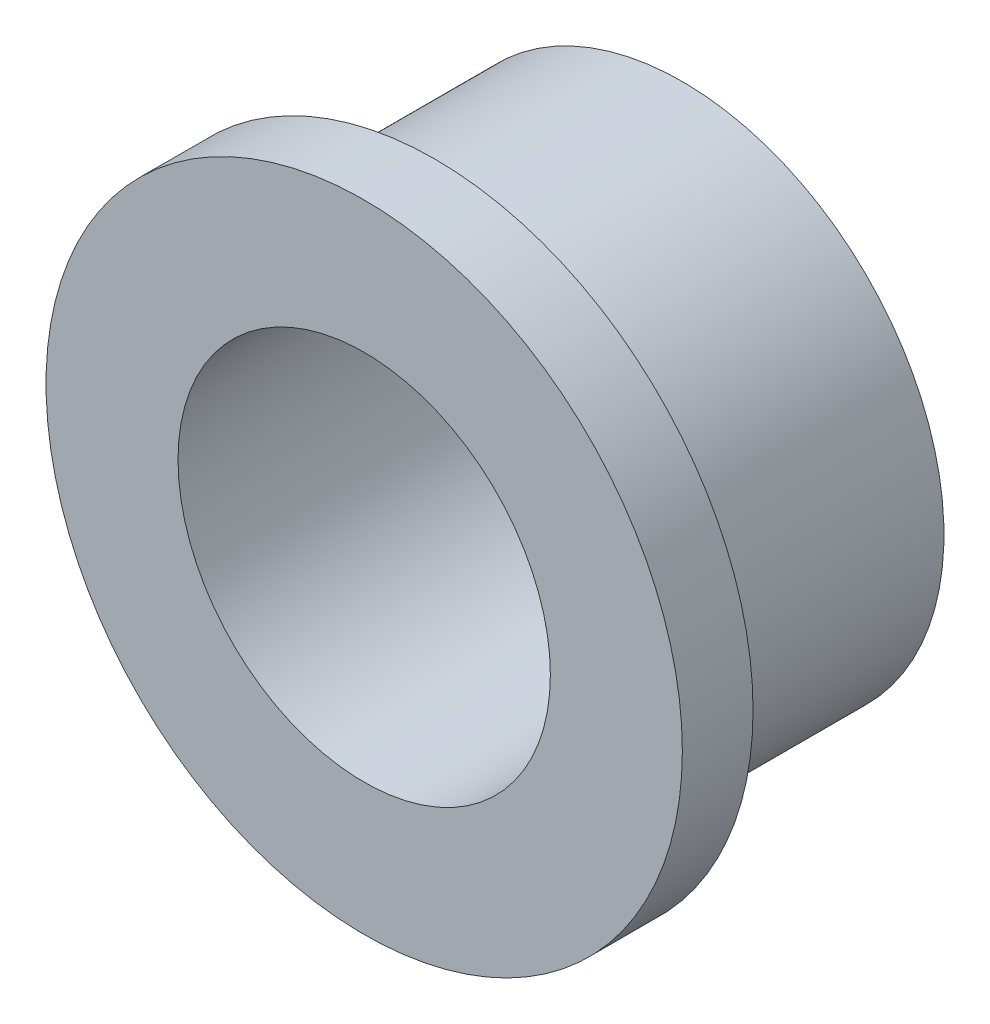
from build123d import *

# Parameters (mm, degrees)
SKETCH_1_R          = 13.5
EXTRUDE_1_DEPTH     = 13.5
SKETCH_2_R          = 7.9
CUT_EXTRUDE_1_DEPTH = 24.382685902
SKETCH_3_OUTSIDE_W  = 37.1
SKETCH_3_OUTSIDE_H  = 37.1
SKETCH_3_OUTSIDE_R  = 11.1
CUT_EXTRUDE_2_DEPTH = 10.5
CHAMFER_1_SIZE      = 1


with BuildPart() as part:
    # Sketch 1 → Extrude 1 (new body)
    with BuildSketch(Plane.XY):
        Circle(SKETCH_1_R)
    extrude(amount=-EXTRUDE_1_DEPTH)

    # Sketch 2 → Cut-Extrude 1 (cut, through all)
    with BuildSketch(Plane.XY):
        Circle(SKETCH_2_R)
    extrude(amount=-CUT_EXTRUDE_1_DEPTH, mode=Mode.SUBTRACT)

    # Sketch 3 outside → Cut-Extrude 2 (cut)
    with BuildSketch(Plane(origin=(0, 0, -13.5), x_dir=(-1, 0, 0), z_dir=(0, 0, -1))):
        Rectangle(SKETCH_3_OUTSIDE_W, SKETCH_3_OUTSIDE_H)
        Circle(SKETCH_3_OUTSIDE_R, mode=Mode.SUBTRACT)
    extrude(amount=-CUT_EXTRUDE_2_DEPTH, mode=Mode.SUBTRACT)

    # Chamfer 1
    chamfer_1_edges = [part.edges().sort_by_distance(p)[0] for p in [
        (-7.9, 0, -13.5),
    ]]
    chamfer(chamfer_1_edges, length=CHAMFER_1_SIZE)


solid = part.part
